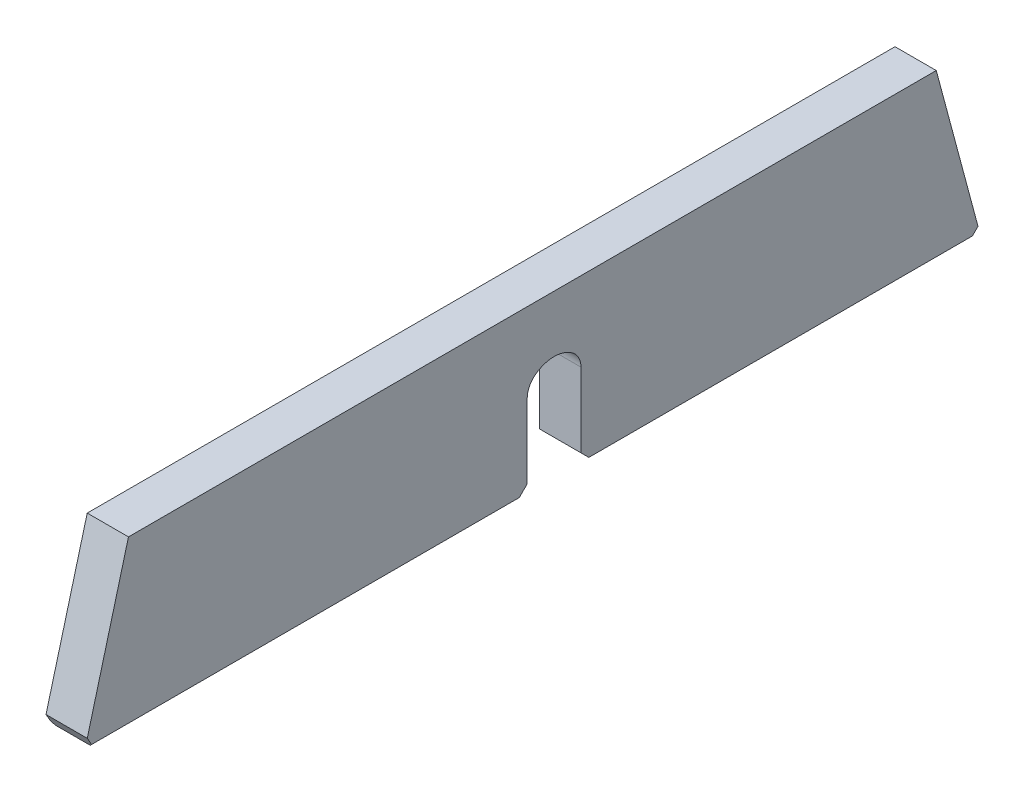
ISO-10303-21;
HEADER;
FILE_DESCRIPTION(('STEP AP214'),'2;1');
FILE_NAME('part.step','',(''),(''),'','','');
FILE_SCHEMA(('AUTOMOTIVE_DESIGN { 1 0 10303 214 1 1 1 1 }'));
ENDSEC;
DATA;
#1=APPLICATION_CONTEXT('core data for automotive mechanical design processes');
#2=APPLICATION_PROTOCOL_DEFINITION('international standard','automotive_design',2000,#1);
#3=PRODUCT_CONTEXT('',#1,'mechanical');
#4=PRODUCT('Part','Part','',(#3));
#5=PRODUCT_RELATED_PRODUCT_CATEGORY('part','',(#4));
#6=PRODUCT_DEFINITION_FORMATION('','',#4);
#7=PRODUCT_DEFINITION_CONTEXT('part definition',#1,'design');
#8=PRODUCT_DEFINITION('design','',#6,#7);
#9=PRODUCT_DEFINITION_SHAPE('','',#8);
#10=(LENGTH_UNIT() NAMED_UNIT(*) SI_UNIT(.MILLI.,.METRE.));
#11=(NAMED_UNIT(*) PLANE_ANGLE_UNIT() SI_UNIT($,.RADIAN.));
#12=(NAMED_UNIT(*) SI_UNIT($,.STERADIAN.) SOLID_ANGLE_UNIT());
#13=UNCERTAINTY_MEASURE_WITH_UNIT(LENGTH_MEASURE(1.E-05),#10,'distance_accuracy_value','');
#14=(GEOMETRIC_REPRESENTATION_CONTEXT(3) GLOBAL_UNCERTAINTY_ASSIGNED_CONTEXT((#13)) GLOBAL_UNIT_ASSIGNED_CONTEXT((#10,
#11,#12)) REPRESENTATION_CONTEXT('',''));
#15=CARTESIAN_POINT('',(0.,0.,0.));
#16=DIRECTION('',(0.,0.,1.));
#17=DIRECTION('',(1.,0.,0.));
#18=AXIS2_PLACEMENT_3D('',#15,#16,#17);
#19=CARTESIAN_POINT('',(101.6,-405.4975,1989.725));
#20=DIRECTION('',(0.,1.,0.));
#21=DIRECTION('',(0.,0.,1.));
#22=AXIS2_PLACEMENT_3D('',#19,#20,#21);
#23=PLANE('',#22);
#24=DIRECTION('',(0.,0.,-1.));
#25=VECTOR('',#24,1.);
#26=CARTESIAN_POINT('',(-85.6,-405.4975,1989.725));
#27=LINE('',#26,#25);
#28=CARTESIAN_POINT('',(-85.6,-405.4975,-294.2875));
#29=VERTEX_POINT('',#28);
#30=CARTESIAN_POINT('',(-85.6,-405.4975,-2152.03045531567));
#31=VERTEX_POINT('',#30);
#32=EDGE_CURVE('E219',#29,#31,#27,.T.);
#33=ORIENTED_EDGE('',*,*,#32,.T.);
#34=DIRECTION('',(1.,0.,0.));
#35=VECTOR('',#34,1.);
#36=CARTESIAN_POINT('',(101.6,-405.4975,-2152.03045531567));
#37=LINE('',#36,#35);
#38=CARTESIAN_POINT('',(85.6,-405.4975,-2152.03045531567));
#39=VERTEX_POINT('',#38);
#40=EDGE_CURVE('E270',#31,#39,#37,.T.);
#41=ORIENTED_EDGE('',*,*,#40,.T.);
#42=DIRECTION('',(0.,0.,1.));
#43=VECTOR('',#42,1.);
#44=CARTESIAN_POINT('',(85.6,-405.4975,-239.2875));
#45=LINE('',#44,#43);
#46=CARTESIAN_POINT('',(85.6,-405.4975,-294.2875));
#47=VERTEX_POINT('',#46);
#48=EDGE_CURVE('E222',#39,#47,#45,.T.);
#49=ORIENTED_EDGE('',*,*,#48,.T.);
#50=DIRECTION('',(-1.,0.,0.));
#51=VECTOR('',#50,1.);
#52=CARTESIAN_POINT('',(101.6,-405.4975,-294.2875));
#53=LINE('',#52,#51);
#54=EDGE_CURVE('E261',#47,#29,#53,.T.);
#55=ORIENTED_EDGE('',*,*,#54,.T.);
#56=EDGE_LOOP('',(#33,#41,#49,#55));
#57=FACE_BOUND('',#56,.T.);
#58=ADVANCED_FACE('F46',(#57),#23,.F.);
#59=CARTESIAN_POINT('',(101.6,405.4975,1989.725));
#60=DIRECTION('',(0.,-1.,0.));
#61=DIRECTION('',(0.,0.,-1.));
#62=AXIS2_PLACEMENT_3D('',#59,#60,#61);
#63=PLANE('',#62);
#64=DIRECTION('',(0.,0.,1.));
#65=VECTOR('',#64,1.);
#66=CARTESIAN_POINT('',(-101.6,405.4975,1989.725));
#67=LINE('',#66,#65);
#68=CARTESIAN_POINT('',(-101.6,405.4975,-1989.725));
#69=VERTEX_POINT('',#68);
#70=CARTESIAN_POINT('',(-101.6,405.4975,1989.725));
#71=VERTEX_POINT('',#70);
#72=EDGE_CURVE('E174',#69,#71,#67,.T.);
#73=ORIENTED_EDGE('',*,*,#72,.T.);
#74=DIRECTION('',(-1.,0.,0.));
#75=VECTOR('',#74,1.);
#76=CARTESIAN_POINT('',(101.6,405.4975,1989.725));
#77=LINE('',#76,#75);
#78=CARTESIAN_POINT('',(101.6,405.4975,1989.725));
#79=VERTEX_POINT('',#78);
#80=EDGE_CURVE('E179',#79,#71,#77,.T.);
#81=ORIENTED_EDGE('',*,*,#80,.F.);
#82=DIRECTION('',(0.,0.,1.));
#83=VECTOR('',#82,1.);
#84=CARTESIAN_POINT('',(101.6,405.4975,1989.725));
#85=LINE('',#84,#83);
#86=CARTESIAN_POINT('',(101.6,405.4975,-1989.725));
#87=VERTEX_POINT('',#86);
#88=EDGE_CURVE('E190',#87,#79,#85,.T.);
#89=ORIENTED_EDGE('',*,*,#88,.F.);
#90=DIRECTION('',(-1.,0.,0.));
#91=VECTOR('',#90,1.);
#92=CARTESIAN_POINT('',(101.6,405.4975,-1989.725));
#93=LINE('',#92,#91);
#94=EDGE_CURVE('E182',#87,#69,#93,.T.);
#95=ORIENTED_EDGE('',*,*,#94,.T.);
#96=EDGE_LOOP('',(#73,#81,#89,#95));
#97=FACE_BOUND('',#96,.T.);
#98=ADVANCED_FACE('F180',(#97),#63,.F.);
#99=DIRECTION('',(0.,0.,-1.));
#100=VECTOR('',#99,1.);
#101=CARTESIAN_POINT('',(-85.5999999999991,-405.4975,1989.725));
#102=LINE('',#101,#100);
#103=CARTESIAN_POINT('',(-85.5999999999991,-405.4975,2162.12314336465));
#104=VERTEX_POINT('',#103);
#105=CARTESIAN_POINT('',(-85.5999999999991,-405.4975,80.276499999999));
#106=VERTEX_POINT('',#105);
#107=EDGE_CURVE('E226',#104,#106,#102,.T.);
#108=ORIENTED_EDGE('',*,*,#107,.T.);
#109=DIRECTION('',(1.,0.,0.));
#110=VECTOR('',#109,1.);
#111=CARTESIAN_POINT('',(101.6,-405.4975,80.276499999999));
#112=LINE('',#111,#110);
#113=CARTESIAN_POINT('',(85.5999999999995,-405.4975,80.2764999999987));
#114=VERTEX_POINT('',#113);
#115=EDGE_CURVE('E295',#106,#114,#112,.T.);
#116=ORIENTED_EDGE('',*,*,#115,.T.);
#117=DIRECTION('',(0.,0.,1.));
#118=VECTOR('',#117,1.);
#119=CARTESIAN_POINT('',(85.5999999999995,-405.4975,2207.03045531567));
#120=LINE('',#119,#118);
#121=CARTESIAN_POINT('',(85.5999999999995,-405.4975,2162.12314336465));
#122=VERTEX_POINT('',#121);
#123=EDGE_CURVE('E233',#114,#122,#120,.T.);
#124=ORIENTED_EDGE('',*,*,#123,.T.);
#125=DIRECTION('',(-1.,0.,0.));
#126=VECTOR('',#125,1.);
#127=CARTESIAN_POINT('',(101.6,-405.4975,2162.12314336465));
#128=LINE('',#127,#126);
#129=EDGE_CURVE('E293',#122,#104,#128,.T.);
#130=ORIENTED_EDGE('',*,*,#129,.T.);
#131=EDGE_LOOP('',(#108,#116,#124,#130));
#132=FACE_BOUND('',#131,.T.);
#133=ADVANCED_FACE('F422',(#132),#23,.F.);
#134=CARTESIAN_POINT('',(101.6,0.,0.));
#135=DIRECTION('',(1.,0.,0.));
#136=DIRECTION('',(0.,0.,-1.));
#137=AXIS2_PLACEMENT_3D('',#134,#135,#136);
#138=PLANE('',#137);
#139=DIRECTION('',(0.,0.,-1.));
#140=VECTOR('',#139,1.);
#141=CARTESIAN_POINT('',(101.6,-389.4975,-2207.03045531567));
#142=LINE('',#141,#140);
#143=CARTESIAN_POINT('',(101.6,-389.4975,-278.2875));
#144=VERTEX_POINT('',#143);
#145=CARTESIAN_POINT('',(101.6,-389.4975,-2168.03045531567));
#146=VERTEX_POINT('',#145);
#147=EDGE_CURVE('E218',#144,#146,#142,.T.);
#148=ORIENTED_EDGE('',*,*,#147,.T.);
#149=DIRECTION('',(0.,-0.707106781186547,0.707106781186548));
#150=VECTOR('',#149,1.);
#151=CARTESIAN_POINT('',(101.6,-1278.76397765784,-1278.76397765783));
#152=LINE('',#151,#150);
#153=CARTESIAN_POINT('',(101.6,-362.120367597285,-2195.40758771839));
#154=VERTEX_POINT('',#153);
#155=EDGE_CURVE('E284',#146,#154,#152,.F.);
#156=ORIENTED_EDGE('',*,*,#155,.T.);
#157=DIRECTION('',(0.,0.96592582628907,0.258819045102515));
#158=VECTOR('',#157,1.);
#159=CARTESIAN_POINT('',(101.6,405.4975,-1989.725));
#160=LINE('',#159,#158);
#161=EDGE_CURVE('E320',#154,#87,#160,.T.);
#162=ORIENTED_EDGE('',*,*,#161,.T.);
#163=ORIENTED_EDGE('',*,*,#88,.T.);
#164=DIRECTION('',(0.,-0.96592582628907,0.258819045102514));
#165=VECTOR('',#164,1.);
#166=CARTESIAN_POINT('',(101.6,405.4975,1989.725));
#167=LINE('',#166,#165);
#168=CARTESIAN_POINT('',(101.6,-352.371579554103,2192.79540783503));
#169=VERTEX_POINT('',#168);
#170=EDGE_CURVE('E196',#79,#169,#167,.T.);
#171=ORIENTED_EDGE('',*,*,#170,.T.);
#172=DIRECTION('',(0.,0.866025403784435,0.500000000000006));
#173=VECTOR('',#172,1.);
#174=CARTESIAN_POINT('',(101.6,-1037.60115913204,1797.17792560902));
#175=LINE('',#174,#173);
#176=CARTESIAN_POINT('',(101.6,-389.4975,2171.36074767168));
#177=VERTEX_POINT('',#176);
#178=EDGE_CURVE('E279',#169,#177,#175,.F.);
#179=ORIENTED_EDGE('',*,*,#178,.T.);
#180=DIRECTION('',(0.,0.,-1.));
#181=VECTOR('',#180,1.);
#182=CARTESIAN_POINT('',(101.6,-389.4975,25.2764999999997));
#183=LINE('',#182,#181);
#184=CARTESIAN_POINT('',(101.6,-389.4975,64.2764999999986));
#185=VERTEX_POINT('',#184);
#186=EDGE_CURVE('E211',#177,#185,#183,.T.);
#187=ORIENTED_EDGE('',*,*,#186,.T.);
#188=DIRECTION('',(0.,-0.707106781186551,0.707106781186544));
#189=VECTOR('',#188,1.);
#190=CARTESIAN_POINT('',(101.6,-162.610499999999,-162.6105));
#191=LINE('',#190,#189);
#192=CARTESIAN_POINT('',(101.6,-350.4975,25.2764999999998));
#193=VERTEX_POINT('',#192);
#194=EDGE_CURVE('E278',#185,#193,#191,.F.);
#195=ORIENTED_EDGE('',*,*,#194,.T.);
#196=DIRECTION('',(0.,-1.,0.));
#197=VECTOR('',#196,1.);
#198=CARTESIAN_POINT('',(101.6,-717.599059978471,25.2764999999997));
#199=LINE('',#198,#197);
#200=CARTESIAN_POINT('',(101.6,15.3246580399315,25.2764999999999));
#201=VERTEX_POINT('',#200);
#202=EDGE_CURVE('E333',#201,#193,#199,.T.);
#203=ORIENTED_EDGE('',*,*,#202,.F.);
#204=CARTESIAN_POINT('',(101.6,15.3246580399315,-74.7235000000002));
#205=DIRECTION('',(1.,0.,0.));
#206=DIRECTION('',(0.,0.,1.));
#207=AXIS2_PLACEMENT_3D('',#204,#205,#206);
#208=CIRCLE('',#207,99.9999999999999);
#209=CARTESIAN_POINT('',(101.6,93.8402975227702,-12.7937465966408));
#210=VERTEX_POINT('',#209);
#211=EDGE_CURVE('E330',#210,#201,#208,.T.);
#212=ORIENTED_EDGE('',*,*,#211,.F.);
#213=CARTESIAN_POINT('',(101.6,-25.6030339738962,-107.0055));
#214=DIRECTION('',(1.,0.,0.));
#215=DIRECTION('',(0.,0.,1.));
#216=AXIS2_PLACEMENT_3D('',#213,#214,#215);
#217=CIRCLE('',#216,152.126802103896);
#218=CARTESIAN_POINT('',(101.6,93.8402975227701,-201.217253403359));
#219=VERTEX_POINT('',#218);
#220=EDGE_CURVE('E325',#219,#210,#217,.T.);
#221=ORIENTED_EDGE('',*,*,#220,.F.);
#222=CARTESIAN_POINT('',(101.6,15.3246580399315,-139.2875));
#223=DIRECTION('',(1.,0.,0.));
#224=DIRECTION('',(0.,0.,-1.));
#225=AXIS2_PLACEMENT_3D('',#222,#223,#224);
#226=CIRCLE('',#225,99.9999999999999);
#227=CARTESIAN_POINT('',(101.6,15.3246580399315,-239.2875));
#228=VERTEX_POINT('',#227);
#229=EDGE_CURVE('E316',#228,#219,#226,.T.);
#230=ORIENTED_EDGE('',*,*,#229,.F.);
#231=DIRECTION('',(0.,1.,0.));
#232=VECTOR('',#231,1.);
#233=CARTESIAN_POINT('',(101.6,-717.599059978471,-239.2875));
#234=LINE('',#233,#232);
#235=CARTESIAN_POINT('',(101.6,-350.4975,-239.2875));
#236=VERTEX_POINT('',#235);
#237=EDGE_CURVE('E206',#236,#228,#234,.T.);
#238=ORIENTED_EDGE('',*,*,#237,.F.);
#239=DIRECTION('',(0.,0.707106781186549,0.707106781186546));
#240=VECTOR('',#239,1.);
#241=CARTESIAN_POINT('',(101.6,-55.6049999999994,55.6049999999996));
#242=LINE('',#241,#240);
#243=EDGE_CURVE('E285',#236,#144,#242,.F.);
#244=ORIENTED_EDGE('',*,*,#243,.T.);
#245=EDGE_LOOP('',(#148,#156,#162,#163,#171,#179,#187,#195,#203,#212,#221,#230,#238,#244));
#246=FACE_BOUND('',#245,.T.);
#247=ADVANCED_FACE('F364',(#246),#138,.T.);
#248=CARTESIAN_POINT('',(-101.6,0.,0.));
#249=DIRECTION('',(1.,0.,0.));
#250=DIRECTION('',(0.,0.,-1.));
#251=AXIS2_PLACEMENT_3D('',#248,#249,#250);
#252=PLANE('',#251);
#253=DIRECTION('',(0.,0.96592582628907,0.258819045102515));
#254=VECTOR('',#253,1.);
#255=CARTESIAN_POINT('',(-101.6,405.4975,-1989.725));
#256=LINE('',#255,#254);
#257=CARTESIAN_POINT('',(-101.6,-362.120367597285,-2195.40758771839));
#258=VERTEX_POINT('',#257);
#259=EDGE_CURVE('E197',#258,#69,#256,.T.);
#260=ORIENTED_EDGE('',*,*,#259,.F.);
#261=DIRECTION('',(0.,0.707106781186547,-0.707106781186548));
#262=VECTOR('',#261,1.);
#263=CARTESIAN_POINT('',(-101.6,-362.120367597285,-2195.40758771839));
#264=LINE('',#263,#262);
#265=CARTESIAN_POINT('',(-101.6,-389.4975,-2168.03045531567));
#266=VERTEX_POINT('',#265);
#267=EDGE_CURVE('E251',#258,#266,#264,.F.);
#268=ORIENTED_EDGE('',*,*,#267,.T.);
#269=DIRECTION('',(0.,0.,1.));
#270=VECTOR('',#269,1.);
#271=CARTESIAN_POINT('',(-101.6,-389.4975,0.));
#272=LINE('',#271,#270);
#273=CARTESIAN_POINT('',(-101.6,-389.4975,-278.2875));
#274=VERTEX_POINT('',#273);
#275=EDGE_CURVE('E238',#266,#274,#272,.T.);
#276=ORIENTED_EDGE('',*,*,#275,.T.);
#277=DIRECTION('',(0.,-0.707106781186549,-0.707106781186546));
#278=VECTOR('',#277,1.);
#279=CARTESIAN_POINT('',(-101.6,-405.4975,-294.2875));
#280=LINE('',#279,#278);
#281=CARTESIAN_POINT('',(-101.6,-350.4975,-239.2875));
#282=VERTEX_POINT('',#281);
#283=EDGE_CURVE('E252',#274,#282,#280,.F.);
#284=ORIENTED_EDGE('',*,*,#283,.T.);
#285=DIRECTION('',(0.,1.,0.));
#286=VECTOR('',#285,1.);
#287=CARTESIAN_POINT('',(-101.6,-717.599059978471,-239.2875));
#288=LINE('',#287,#286);
#289=CARTESIAN_POINT('',(-101.6,15.3246580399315,-239.2875));
#290=VERTEX_POINT('',#289);
#291=EDGE_CURVE('E202',#282,#290,#288,.T.);
#292=ORIENTED_EDGE('',*,*,#291,.T.);
#293=CARTESIAN_POINT('',(-101.6,15.3246580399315,-139.2875));
#294=DIRECTION('',(1.,0.,0.));
#295=DIRECTION('',(0.,0.,-1.));
#296=AXIS2_PLACEMENT_3D('',#293,#294,#295);
#297=CIRCLE('',#296,99.9999999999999);
#298=CARTESIAN_POINT('',(-101.6,93.8402975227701,-201.217253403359));
#299=VERTEX_POINT('',#298);
#300=EDGE_CURVE('E332',#290,#299,#297,.T.);
#301=ORIENTED_EDGE('',*,*,#300,.T.);
#302=CARTESIAN_POINT('',(-101.6,-25.6030339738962,-107.0055));
#303=DIRECTION('',(1.,0.,0.));
#304=DIRECTION('',(0.,0.,1.));
#305=AXIS2_PLACEMENT_3D('',#302,#303,#304);
#306=CIRCLE('',#305,152.126802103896);
#307=CARTESIAN_POINT('',(-101.6,93.8402975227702,-12.7937465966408));
#308=VERTEX_POINT('',#307);
#309=EDGE_CURVE('E339',#299,#308,#306,.T.);
#310=ORIENTED_EDGE('',*,*,#309,.T.);
#311=CARTESIAN_POINT('',(-101.6,15.3246580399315,-74.7235000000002));
#312=DIRECTION('',(1.,0.,0.));
#313=DIRECTION('',(0.,0.,1.));
#314=AXIS2_PLACEMENT_3D('',#311,#312,#313);
#315=CIRCLE('',#314,99.9999999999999);
#316=CARTESIAN_POINT('',(-101.6,15.3246580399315,25.2764999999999));
#317=VERTEX_POINT('',#316);
#318=EDGE_CURVE('E345',#308,#317,#315,.T.);
#319=ORIENTED_EDGE('',*,*,#318,.T.);
#320=DIRECTION('',(0.,-1.,0.));
#321=VECTOR('',#320,1.);
#322=CARTESIAN_POINT('',(-101.6,-717.599059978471,25.2764999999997));
#323=LINE('',#322,#321);
#324=CARTESIAN_POINT('',(-101.6,-350.4975,25.2764999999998));
#325=VERTEX_POINT('',#324);
#326=EDGE_CURVE('E350',#317,#325,#323,.T.);
#327=ORIENTED_EDGE('',*,*,#326,.T.);
#328=DIRECTION('',(0.,0.707106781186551,-0.707106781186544));
#329=VECTOR('',#328,1.);
#330=CARTESIAN_POINT('',(-101.6,-405.4975,80.276499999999));
#331=LINE('',#330,#329);
#332=CARTESIAN_POINT('',(-101.6,-389.4975,64.2764999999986));
#333=VERTEX_POINT('',#332);
#334=EDGE_CURVE('E247',#325,#333,#331,.F.);
#335=ORIENTED_EDGE('',*,*,#334,.T.);
#336=DIRECTION('',(0.,0.,1.));
#337=VECTOR('',#336,1.);
#338=CARTESIAN_POINT('',(-101.6,-389.4975,0.));
#339=LINE('',#338,#337);
#340=CARTESIAN_POINT('',(-101.6,-389.4975,2171.36074767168));
#341=VERTEX_POINT('',#340);
#342=EDGE_CURVE('E232',#333,#341,#339,.T.);
#343=ORIENTED_EDGE('',*,*,#342,.T.);
#344=DIRECTION('',(0.,-0.866025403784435,-0.500000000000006));
#345=VECTOR('',#344,1.);
#346=CARTESIAN_POINT('',(-101.6,-405.4975,2162.12314336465));
#347=LINE('',#346,#345);
#348=CARTESIAN_POINT('',(-101.6,-352.371579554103,2192.79540783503));
#349=VERTEX_POINT('',#348);
#350=EDGE_CURVE('E193',#341,#349,#347,.F.);
#351=ORIENTED_EDGE('',*,*,#350,.T.);
#352=DIRECTION('',(0.,-0.96592582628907,0.258819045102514));
#353=VECTOR('',#352,1.);
#354=CARTESIAN_POINT('',(-101.6,405.4975,1989.725));
#355=LINE('',#354,#353);
#356=EDGE_CURVE('E194',#71,#349,#355,.T.);
#357=ORIENTED_EDGE('',*,*,#356,.F.);
#358=ORIENTED_EDGE('',*,*,#72,.F.);
#359=EDGE_LOOP('',(#260,#268,#276,#284,#292,#301,#310,#319,#327,#335,#343,#351,#357,#358));
#360=FACE_BOUND('',#359,.T.);
#361=ADVANCED_FACE('F191',(#360),#252,.F.);
#362=CARTESIAN_POINT('',(-101.6,-717.599059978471,-239.2875));
#363=DIRECTION('',(0.,0.,-1.));
#364=DIRECTION('',(0.,1.,0.));
#365=AXIS2_PLACEMENT_3D('',#362,#363,#364);
#366=PLANE('',#365);
#367=ORIENTED_EDGE('',*,*,#291,.F.);
#368=DIRECTION('',(1.,0.,0.));
#369=VECTOR('',#368,1.);
#370=CARTESIAN_POINT('',(-101.6,-350.4975,-239.2875));
#371=LINE('',#370,#369);
#372=EDGE_CURVE('E286',#282,#236,#371,.T.);
#373=ORIENTED_EDGE('',*,*,#372,.T.);
#374=ORIENTED_EDGE('',*,*,#237,.T.);
#375=DIRECTION('',(1.,0.,0.));
#376=VECTOR('',#375,1.);
#377=CARTESIAN_POINT('',(-101.6,15.3246580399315,-239.2875));
#378=LINE('',#377,#376);
#379=EDGE_CURVE('E353',#290,#228,#378,.T.);
#380=ORIENTED_EDGE('',*,*,#379,.F.);
#381=EDGE_LOOP('',(#367,#373,#374,#380));
#382=FACE_BOUND('',#381,.T.);
#383=ADVANCED_FACE('F400',(#382),#366,.F.);
#384=CARTESIAN_POINT('',(-101.6,-717.599059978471,25.2764999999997));
#385=DIRECTION('',(0.,0.,1.));
#386=DIRECTION('',(0.,-1.,0.));
#387=AXIS2_PLACEMENT_3D('',#384,#385,#386);
#388=PLANE('',#387);
#389=ORIENTED_EDGE('',*,*,#202,.T.);
#390=DIRECTION('',(-1.,0.,0.));
#391=VECTOR('',#390,1.);
#392=CARTESIAN_POINT('',(-101.6,-350.4975,25.2764999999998));
#393=LINE('',#392,#391);
#394=EDGE_CURVE('E302',#193,#325,#393,.T.);
#395=ORIENTED_EDGE('',*,*,#394,.T.);
#396=ORIENTED_EDGE('',*,*,#326,.F.);
#397=DIRECTION('',(1.,0.,0.));
#398=VECTOR('',#397,1.);
#399=CARTESIAN_POINT('',(-101.6,15.3246580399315,25.2764999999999));
#400=LINE('',#399,#398);
#401=EDGE_CURVE('E189',#317,#201,#400,.T.);
#402=ORIENTED_EDGE('',*,*,#401,.T.);
#403=EDGE_LOOP('',(#389,#395,#396,#402));
#404=FACE_BOUND('',#403,.T.);
#405=ADVANCED_FACE('F411',(#404),#388,.F.);
#406=CARTESIAN_POINT('',(-101.6,15.3246580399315,-74.7235000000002));
#407=DIRECTION('',(1.,0.,0.));
#408=DIRECTION('',(0.,0.,-1.));
#409=AXIS2_PLACEMENT_3D('',#406,#407,#408);
#410=CYLINDRICAL_SURFACE('',#409,99.9999999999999);
#411=ORIENTED_EDGE('',*,*,#401,.F.);
#412=ORIENTED_EDGE('',*,*,#318,.F.);
#413=DIRECTION('',(1.,0.,0.));
#414=VECTOR('',#413,1.);
#415=CARTESIAN_POINT('',(-101.6,93.8402975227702,-12.7937465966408));
#416=LINE('',#415,#414);
#417=EDGE_CURVE('E352',#308,#210,#416,.T.);
#418=ORIENTED_EDGE('',*,*,#417,.T.);
#419=ORIENTED_EDGE('',*,*,#211,.T.);
#420=EDGE_LOOP('',(#411,#412,#418,#419));
#421=FACE_BOUND('',#420,.T.);
#422=ADVANCED_FACE('F408',(#421),#410,.F.);
#423=CARTESIAN_POINT('',(-101.6,-25.6030339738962,-107.0055));
#424=DIRECTION('',(1.,0.,0.));
#425=DIRECTION('',(0.,0.,-1.));
#426=AXIS2_PLACEMENT_3D('',#423,#424,#425);
#427=CYLINDRICAL_SURFACE('',#426,152.126802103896);
#428=ORIENTED_EDGE('',*,*,#417,.F.);
#429=ORIENTED_EDGE('',*,*,#309,.F.);
#430=DIRECTION('',(1.,0.,0.));
#431=VECTOR('',#430,1.);
#432=CARTESIAN_POINT('',(-101.6,93.8402975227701,-201.217253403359));
#433=LINE('',#432,#431);
#434=EDGE_CURVE('E357',#299,#219,#433,.T.);
#435=ORIENTED_EDGE('',*,*,#434,.T.);
#436=ORIENTED_EDGE('',*,*,#220,.T.);
#437=EDGE_LOOP('',(#428,#429,#435,#436));
#438=FACE_BOUND('',#437,.T.);
#439=ADVANCED_FACE('F403',(#438),#427,.F.);
#440=CARTESIAN_POINT('',(-101.6,15.3246580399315,-139.2875));
#441=DIRECTION('',(1.,0.,0.));
#442=DIRECTION('',(0.,0.,-1.));
#443=AXIS2_PLACEMENT_3D('',#440,#441,#442);
#444=CYLINDRICAL_SURFACE('',#443,99.9999999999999);
#445=ORIENTED_EDGE('',*,*,#434,.F.);
#446=ORIENTED_EDGE('',*,*,#300,.F.);
#447=ORIENTED_EDGE('',*,*,#379,.T.);
#448=ORIENTED_EDGE('',*,*,#229,.T.);
#449=EDGE_LOOP('',(#445,#446,#447,#448));
#450=FACE_BOUND('',#449,.T.);
#451=ADVANCED_FACE('F402',(#450),#444,.F.);
#452=CARTESIAN_POINT('',(101.6,405.4975,-1989.725));
#453=DIRECTION('',(0.,-0.258819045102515,0.96592582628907));
#454=DIRECTION('',(0.,-0.96592582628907,-0.258819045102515));
#455=AXIS2_PLACEMENT_3D('',#452,#453,#454);
#456=PLANE('',#455);
#457=ORIENTED_EDGE('',*,*,#161,.F.);
#458=DIRECTION('',(-1.,0.,0.));
#459=VECTOR('',#458,1.);
#460=CARTESIAN_POINT('',(101.6,-362.120367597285,-2195.40758771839));
#461=LINE('',#460,#459);
#462=EDGE_CURVE('E245',#154,#258,#461,.T.);
#463=ORIENTED_EDGE('',*,*,#462,.T.);
#464=ORIENTED_EDGE('',*,*,#259,.T.);
#465=ORIENTED_EDGE('',*,*,#94,.F.);
#466=EDGE_LOOP('',(#457,#463,#464,#465));
#467=FACE_BOUND('',#466,.T.);
#468=ADVANCED_FACE('F368',(#467),#456,.F.);
#469=CARTESIAN_POINT('',(101.6,405.4975,1989.725));
#470=DIRECTION('',(0.,-0.258819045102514,-0.96592582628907));
#471=DIRECTION('',(0.,0.96592582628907,-0.258819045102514));
#472=AXIS2_PLACEMENT_3D('',#469,#470,#471);
#473=PLANE('',#472);
#474=ORIENTED_EDGE('',*,*,#356,.T.);
#475=DIRECTION('',(1.,0.,0.));
#476=VECTOR('',#475,1.);
#477=CARTESIAN_POINT('',(101.6,-352.371579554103,2192.79540783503));
#478=LINE('',#477,#476);
#479=EDGE_CURVE('E11',#349,#169,#478,.T.);
#480=ORIENTED_EDGE('',*,*,#479,.T.);
#481=ORIENTED_EDGE('',*,*,#170,.F.);
#482=ORIENTED_EDGE('',*,*,#80,.T.);
#483=EDGE_LOOP('',(#474,#480,#481,#482));
#484=FACE_BOUND('',#483,.T.);
#485=ADVANCED_FACE('F203',(#484),#473,.F.);
#486=CARTESIAN_POINT('',(101.6,-389.4975,0.));
#487=DIRECTION('',(0.707106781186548,-0.707106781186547,0.));
#488=DIRECTION('',(0.,0.,1.));
#489=AXIS2_PLACEMENT_3D('',#486,#487,#488);
#490=PLANE('',#489);
#491=ORIENTED_EDGE('',*,*,#48,.F.);
#492=DIRECTION('',(-0.577350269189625,-0.577350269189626,0.577350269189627));
#493=VECTOR('',#492,1.);
#494=CARTESIAN_POINT('',(-621.076818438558,-1112.17431843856,-1445.35363687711));
#495=LINE('',#494,#493);
#496=EDGE_CURVE('E271',#39,#146,#495,.F.);
#497=ORIENTED_EDGE('',*,*,#496,.T.);
#498=ORIENTED_EDGE('',*,*,#147,.F.);
#499=DIRECTION('',(0.577350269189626,0.577350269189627,0.577350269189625));
#500=VECTOR('',#499,1.);
#501=CARTESIAN_POINT('',(194.3625,-296.735,-185.525));
#502=LINE('',#501,#500);
#503=EDGE_CURVE('E269',#144,#47,#502,.F.);
#504=ORIENTED_EDGE('',*,*,#503,.T.);
#505=EDGE_LOOP('',(#491,#497,#498,#504));
#506=FACE_BOUND('',#505,.T.);
#507=ADVANCED_FACE('F388',(#506),#490,.T.);
#508=CARTESIAN_POINT('',(101.6,-389.4975,0.));
#509=DIRECTION('',(0.707106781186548,-0.707106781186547,0.));
#510=DIRECTION('',(0.,0.,1.));
#511=AXIS2_PLACEMENT_3D('',#508,#509,#510);
#512=PLANE('',#511);
#513=ORIENTED_EDGE('',*,*,#123,.F.);
#514=DIRECTION('',(-0.577350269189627,-0.577350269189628,0.577350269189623));
#515=VECTOR('',#514,1.);
#516=CARTESIAN_POINT('',(123.025499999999,-368.072,42.8509999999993));
#517=LINE('',#516,#515);
#518=EDGE_CURVE('E301',#114,#185,#517,.F.);
#519=ORIENTED_EDGE('',*,*,#518,.T.);
#520=ORIENTED_EDGE('',*,*,#186,.F.);
#521=DIRECTION('',(0.654653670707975,0.654653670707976,0.377964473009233));
#522=VECTOR('',#521,1.);
#523=CARTESIAN_POINT('',(-435.672448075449,-926.76994807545,1861.16635514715));
#524=LINE('',#523,#522);
#525=EDGE_CURVE('E296',#177,#122,#524,.F.);
#526=ORIENTED_EDGE('',*,*,#525,.T.);
#527=EDGE_LOOP('',(#513,#519,#520,#526));
#528=FACE_BOUND('',#527,.T.);
#529=ADVANCED_FACE('F425',(#528),#512,.T.);
#530=CARTESIAN_POINT('',(-85.6,-405.4975,1989.725));
#531=DIRECTION('',(0.707106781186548,0.707106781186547,0.));
#532=DIRECTION('',(0.,0.,-1.));
#533=AXIS2_PLACEMENT_3D('',#530,#531,#532);
#534=PLANE('',#533);
#535=ORIENTED_EDGE('',*,*,#275,.F.);
#536=DIRECTION('',(0.577350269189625,-0.577350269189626,0.577350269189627));
#537=VECTOR('',#536,1.);
#538=CARTESIAN_POINT('',(1294.98515177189,-1786.08265177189,-771.445303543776));
#539=LINE('',#538,#537);
#540=EDGE_CURVE('E257',#266,#31,#539,.T.);
#541=ORIENTED_EDGE('',*,*,#540,.T.);
#542=ORIENTED_EDGE('',*,*,#32,.F.);
#543=DIRECTION('',(-0.577350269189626,0.577350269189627,0.577350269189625));
#544=VECTOR('',#543,1.);
#545=CARTESIAN_POINT('',(-846.937499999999,355.84,467.049999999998));
#546=LINE('',#545,#544);
#547=EDGE_CURVE('E256',#29,#274,#546,.T.);
#548=ORIENTED_EDGE('',*,*,#547,.T.);
#549=EDGE_LOOP('',(#535,#541,#542,#548));
#550=FACE_BOUND('',#549,.T.);
#551=ADVANCED_FACE('F378',(#550),#534,.F.);
#552=CARTESIAN_POINT('',(-85.5999999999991,-405.4975,1989.725));
#553=DIRECTION('',(0.707106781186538,0.707106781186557,0.));
#554=DIRECTION('',(0.,0.,-1.));
#555=AXIS2_PLACEMENT_3D('',#552,#553,#554);
#556=PLANE('',#555);
#557=ORIENTED_EDGE('',*,*,#342,.F.);
#558=DIRECTION('',(0.577350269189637,-0.577350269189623,0.577350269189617));
#559=VECTOR('',#558,1.);
#560=CARTESIAN_POINT('',(550.882833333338,-1041.98033333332,716.759333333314));
#561=LINE('',#560,#559);
#562=EDGE_CURVE('E57',#333,#106,#561,.T.);
#563=ORIENTED_EDGE('',*,*,#562,.T.);
#564=ORIENTED_EDGE('',*,*,#107,.F.);
#565=DIRECTION('',(-0.654653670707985,0.654653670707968,0.377964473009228));
#566=VECTOR('',#565,1.);
#567=CARTESIAN_POINT('',(-42.942522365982,-448.154977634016,2137.4948371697));
#568=LINE('',#567,#566);
#569=EDGE_CURVE('E69',#104,#341,#568,.T.);
#570=ORIENTED_EDGE('',*,*,#569,.T.);
#571=EDGE_LOOP('',(#557,#563,#564,#570));
#572=FACE_BOUND('',#571,.T.);
#573=ADVANCED_FACE('F430',(#572),#556,.F.);
#574=CARTESIAN_POINT('',(101.6,-362.120367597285,-2195.40758771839));
#575=DIRECTION('',(0.,0.707106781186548,0.707106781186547));
#576=DIRECTION('',(-1.,0.,0.));
#577=AXIS2_PLACEMENT_3D('',#574,#575,#576);
#578=PLANE('',#577);
#579=ORIENTED_EDGE('',*,*,#496,.F.);
#580=ORIENTED_EDGE('',*,*,#40,.F.);
#581=ORIENTED_EDGE('',*,*,#540,.F.);
#582=ORIENTED_EDGE('',*,*,#267,.F.);
#583=ORIENTED_EDGE('',*,*,#462,.F.);
#584=ORIENTED_EDGE('',*,*,#155,.F.);
#585=EDGE_LOOP('',(#579,#580,#581,#582,#583,#584));
#586=FACE_BOUND('',#585,.T.);
#587=ADVANCED_FACE('F384',(#586),#578,.F.);
#588=CARTESIAN_POINT('',(101.6,-405.4975,-294.2875));
#589=DIRECTION('',(0.,0.707106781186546,-0.707106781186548));
#590=DIRECTION('',(-1.,0.,0.));
#591=AXIS2_PLACEMENT_3D('',#588,#589,#590);
#592=PLANE('',#591);
#593=ORIENTED_EDGE('',*,*,#243,.F.);
#594=ORIENTED_EDGE('',*,*,#372,.F.);
#595=ORIENTED_EDGE('',*,*,#283,.F.);
#596=ORIENTED_EDGE('',*,*,#547,.F.);
#597=ORIENTED_EDGE('',*,*,#54,.F.);
#598=ORIENTED_EDGE('',*,*,#503,.F.);
#599=EDGE_LOOP('',(#593,#594,#595,#596,#597,#598));
#600=FACE_BOUND('',#599,.T.);
#601=ADVANCED_FACE('F392',(#600),#592,.F.);
#602=CARTESIAN_POINT('',(101.6,-405.4975,80.276499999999));
#603=DIRECTION('',(0.,0.707106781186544,0.707106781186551));
#604=DIRECTION('',(1.,0.,0.));
#605=AXIS2_PLACEMENT_3D('',#602,#603,#604);
#606=PLANE('',#605);
#607=ORIENTED_EDGE('',*,*,#334,.F.);
#608=ORIENTED_EDGE('',*,*,#394,.F.);
#609=ORIENTED_EDGE('',*,*,#194,.F.);
#610=ORIENTED_EDGE('',*,*,#518,.F.);
#611=ORIENTED_EDGE('',*,*,#115,.F.);
#612=ORIENTED_EDGE('',*,*,#562,.F.);
#613=EDGE_LOOP('',(#607,#608,#609,#610,#611,#612));
#614=FACE_BOUND('',#613,.T.);
#615=ADVANCED_FACE('F420',(#614),#606,.F.);
#616=CARTESIAN_POINT('',(101.6,-405.4975,2162.12314336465));
#617=DIRECTION('',(0.,0.500000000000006,-0.866025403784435));
#618=DIRECTION('',(-1.,0.,0.));
#619=AXIS2_PLACEMENT_3D('',#616,#617,#618);
#620=PLANE('',#619);
#621=ORIENTED_EDGE('',*,*,#178,.F.);
#622=ORIENTED_EDGE('',*,*,#479,.F.);
#623=ORIENTED_EDGE('',*,*,#350,.F.);
#624=ORIENTED_EDGE('',*,*,#569,.F.);
#625=ORIENTED_EDGE('',*,*,#129,.F.);
#626=ORIENTED_EDGE('',*,*,#525,.F.);
#627=EDGE_LOOP('',(#621,#622,#623,#624,#625,#626));
#628=FACE_BOUND('',#627,.T.);
#629=ADVANCED_FACE('F47',(#628),#620,.F.);
#630=CLOSED_SHELL('',(#58,#98,#133,#247,#361,#383,#405,#422,#439,#451,#468,#485,#507,#529,#551,
#573,#587,#601,#615,#629));
#631=MANIFOLD_SOLID_BREP('B2',#630);
#632=ADVANCED_BREP_SHAPE_REPRESENTATION('',(#18,#631),#14);
#633=SHAPE_DEFINITION_REPRESENTATION(#9,#632);
ENDSEC;
END-ISO-10303-21;
